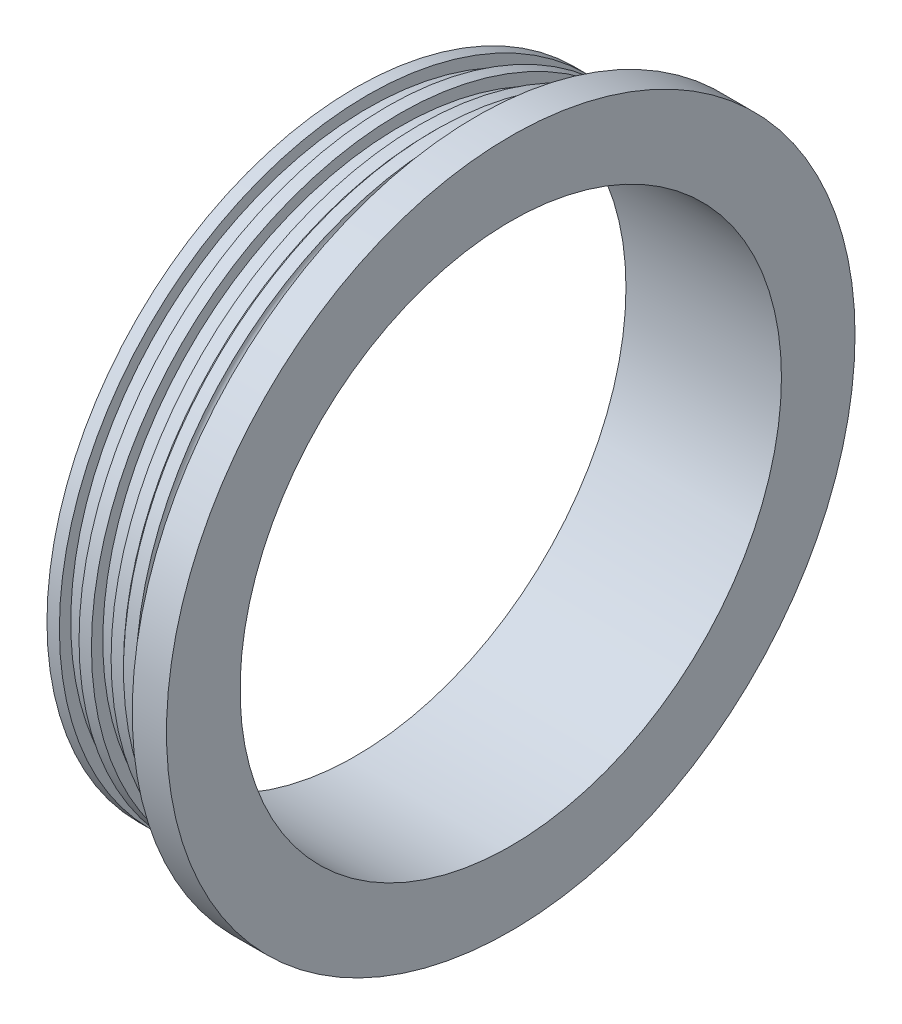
from build123d import *

# Parameters (mm, degrees)
SKETCH2_W           = 2.9972
SKETCH2_H           = 2.7432
SKETCH2_W_2         = 0.762
SKETCH2_W_3         = 5.1054
SKETCH2_H_2         = 7.9248
SKETCH3_R           = 83.185
SKETCH3_R_2         = 65.405
BOSS_EXTRUDE1_DEPTH = 3.175


with BuildPart() as part:
    # Sketch2 → Revolve1 (revolve)
    with BuildSketch(Plane(origin=(0, 0, 0), x_dir=(1, 0, 0), z_dir=(0, 1, 0))):
        Polygon((-17.1958, 65.405), (0, 65.405), (0, 71.755), (-15.1384, 71.755), (-15.9004, 71.755), (-17.1958, 71.755), align=None)
        Polygon((-34.3916, 65.405), (-17.1958, 65.405), (-17.1958, 71.755), (-18.8976, 71.755), (-23.6474, 71.755), (-26.6446, 71.755), (-31.3944, 71.755), (-34.3916, 71.755), align=None)
        with Locations((-32.893, 73.1266)):
            Rectangle(SKETCH2_W, SKETCH2_H)
        with Locations((-25.146, 73.1266)):
            Rectangle(SKETCH2_W, SKETCH2_H)
        Polygon((-18.8976, 71.755), (-17.1958, 71.755), (-15.9004, 71.755), (-15.9004, 74.4982), (-18.8976, 74.4982), align=None)
        with BuildLine():
            Line((-15.1384, 71.755), (0, 71.755))
            Line((0, 71.755), (0, 75.2602))
            Line((0, 75.2602), (-5.1054, 75.2602))
            Line((-5.1054, 75.2602), (-8.5598, 75.2602))
            ThreePointArc((-8.5598, 75.2602), (-10.3505, 73.4695), (-12.1412, 75.2602))
            Line((-12.1412, 75.2602), (-15.1384, 75.2602))
            Line((-15.1384, 75.2602), (-15.1384, 74.4982))
            Line((-15.1384, 74.4982), (-15.1384, 71.755))
        make_face()
        with Locations((-15.5194, 73.1266)):
            Rectangle(SKETCH2_W_2, SKETCH2_H)
        Polygon((-15.9004, 74.4982), (-15.1384, 74.4982), (-15.1384, 75.2602), align=None)
        with Locations((-2.5527, 79.2226)):
            Rectangle(SKETCH2_W_3, SKETCH2_H_2)
    revolve(axis=Axis((0, 0, 0), (-1, 0, 0)))

    # Sketch3 → Boss-Extrude1 (add)
    with BuildSketch(Plane(origin=(0, 0, 0), x_dir=(0, 0, -1), z_dir=(1, 0, 0))):
        Circle(SKETCH3_R)
        Circle(SKETCH3_R_2, mode=Mode.SUBTRACT)
    extrude(amount=BOSS_EXTRUDE1_DEPTH)


solid = part.part
